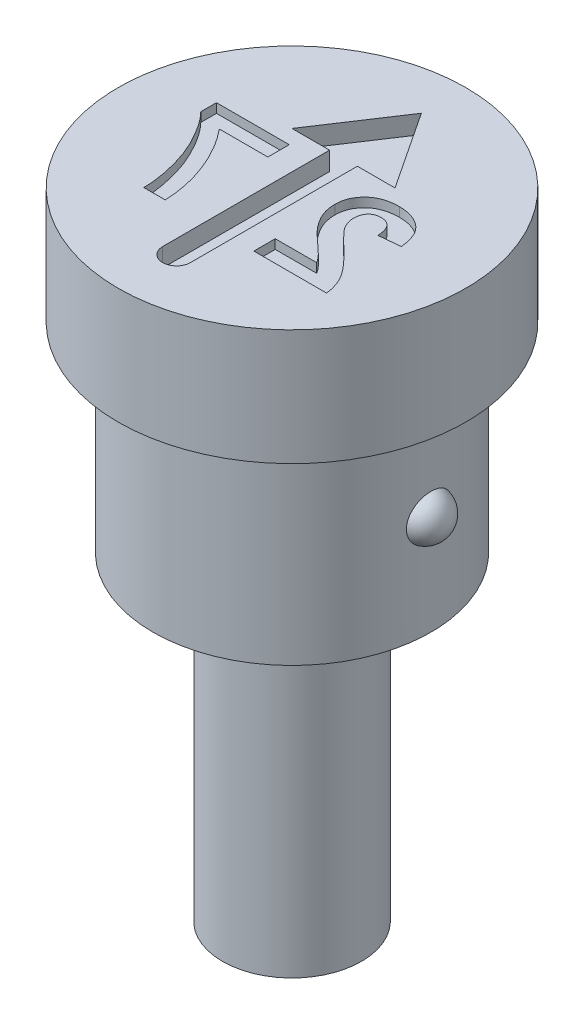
from build123d import *

# Parameters (mm, degrees)
CUT_EXTRUDE1_DEPTH = 0.4
CUT_EXTRUDE2_DEPTH = 0.2


with BuildPart() as part:
    # Sketch1 → Revolve1 (revolve)
    with BuildSketch(Plane.XY, mode=Mode.PRIVATE) as revolve1_sk:
        Polygon((0, 0), (-3.75, 0), (-3.75, -2.5), (-3, -2.5), (-3, -6.8), (-1.5, -6.8), (-1.5, -13.7), (0, -13.7), align=None)
    revolve(revolve1_sk.sketch.rotate(Axis((0, 0, 0), (0, -1, 0)), 270), axis=Axis((0, 0, 0), (0, -1, 0)))

    # Sketch3 → Cut-Extrude1 (cut)
    with BuildSketch(Plane(origin=(0, 0, 0), x_dir=(1, 0, 0), z_dir=(0, 1, 0))):
        with BuildLine():
            Line((0, 2.79), (-1.111967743, 1.11))
            Line((-1.111967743, 1.11), (-0.3, 1.11))
            Line((-0.3, 1.11), (-0.3, -2.49))
            ThreePointArc((-0.3, -2.49), (0, -2.79), (0.3, -2.49))
            Line((0.3, -2.49), (0.3, 1.11))
            Line((0.3, 1.11), (1.111967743, 1.11))
            Line((1.111967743, 1.11), (0, 2.79))
        make_face()
    extrude(amount=-CUT_EXTRUDE1_DEPTH, mode=Mode.SUBTRACT)

    # Sketch4 → Cut-Extrude2 (cut)
    with BuildSketch(Plane(origin=(0, 0, 0), x_dir=(1, 0, 0), z_dir=(0, 1, 0))):
        with BuildLine():
            Line((0.768356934, -1.129759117), (0.768356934, -1.591297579))
            Line((0.768356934, -1.591297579), (2.337587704, -1.591297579))
            add(Edge.make_bspline(
                [(2.337587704, -1.591297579), (2.332274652, -1.551852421), (2.321651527, -1.472984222), (2.288808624, -1.357777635), (2.244974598, -1.24535569), (2.19740109, -1.153871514), (2.150083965, -1.080229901), (2.107153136, -1.019887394), (2.055938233, -0.955685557), (1.99718244, -0.887106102), (1.931210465, -0.813934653), (1.857530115, -0.736443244), (1.775789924, -0.655002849), (1.718284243, -0.599700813), (1.688549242, -0.571105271)],
                knots=[0, 0, 0, 0, 1.156289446, 2.311930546, 3.473459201, 4.661751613, 5.303057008, 6.018253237, 6.81459331, 7.690699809, 8.644447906, 9.679642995, 10.800191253, 12, 12, 12, 12], degree=3))
            add(Edge.make_bspline(
                [(1.688549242, -0.571105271), (1.664820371, -0.548200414), (1.619647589, -0.504596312), (1.55532146, -0.442157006), (1.498772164, -0.384757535), (1.448817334, -0.333885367), (1.406610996, -0.288245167), (1.371597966, -0.248553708), (1.343334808, -0.214649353), (1.328027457, -0.193140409), (1.32124155, -0.183605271)],
                knots=[0, 0, 0, 0, 1.480720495, 2.818855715, 4.024636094, 5.098235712, 6.019786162, 6.815086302, 7.474715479, 8, 8, 8, 8], degree=3))
            add(Edge.make_bspline(
                [(1.32124155, -0.183605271), (1.307345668, -0.160522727), (1.280542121, -0.115999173), (1.251149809, -0.045985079), (1.233507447, 0.024014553), (1.231086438, 0.070787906), (1.229895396, 0.093798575)],
                knots=[0, 0, 0, 0, 1.0911822, 2.104764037, 3.067617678, 4, 4, 4, 4], degree=3))
            add(Edge.make_bspline(
                [(1.229895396, 0.093798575), (1.230759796, 0.11774427), (1.232395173, 0.163047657), (1.246108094, 0.226979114), (1.270425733, 0.281937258), (1.303906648, 0.328090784), (1.346243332, 0.364251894), (1.395736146, 0.390971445), (1.453109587, 0.405743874), (1.493435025, 0.40768691), (1.51451078, 0.408702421)],
                knots=[0, 0, 0, 0, 1.193122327, 2.257294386, 3.237245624, 4.168877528, 5.075331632, 5.990371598, 6.949684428, 8, 8, 8, 8], degree=3))
            add(Edge.make_bspline(
                [(1.51451078, 0.408702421), (1.53544415, 0.40775401), (1.575882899, 0.405921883), (1.633355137, 0.389916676), (1.683632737, 0.362209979), (1.719463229, 0.330635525), (1.743668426, 0.299931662), (1.760161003, 0.273175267), (1.774376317, 0.242771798), (1.786972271, 0.209063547), (1.79692165, 0.171664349), (1.804934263, 0.130859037), (1.811391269, 0.086428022), (1.813444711, 0.055518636), (1.81451078, 0.039471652)],
                knots=[0, 0, 0, 0, 1.402788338, 2.709884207, 3.961032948, 5.225417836, 5.883680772, 6.578928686, 7.329201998, 8.132101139, 8.990263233, 9.922304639, 10.921339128, 12, 12, 12, 12], degree=3))
            Line((1.81451078, 0.039471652), (2.276049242, 0.08466396))
            add(Edge.make_bspline(
                [(2.276049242, 0.08466396), (2.272338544, 0.115823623), (2.265144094, 0.176237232), (2.247190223, 0.263012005), (2.224452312, 0.34306565), (2.195846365, 0.416249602), (2.162554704, 0.48302924), (2.122879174, 0.542402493), (2.078206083, 0.59502705), (2.028496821, 0.640874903), (1.974067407, 0.680091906), (1.916953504, 0.715099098), (1.856038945, 0.743816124), (1.791994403, 0.767483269), (1.724848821, 0.786397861), (1.65429164, 0.798903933), (1.580758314, 0.807700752), (1.530564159, 0.808363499), (1.504895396, 0.808702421)],
                knots=[0, 0, 0, 0, 1.270971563, 2.464210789, 3.586263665, 4.638946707, 5.643716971, 6.603612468, 7.52484387, 8.434700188, 9.336036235, 10.239171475, 11.145359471, 12.059630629, 13.003312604, 13.96741569, 14.960557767, 16, 16, 16, 16], degree=3))
            add(Edge.make_bspline(
                [(1.504895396, 0.808702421), (1.476990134, 0.808166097), (1.422641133, 0.807121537), (1.343301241, 0.798495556), (1.268767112, 0.783454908), (1.198387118, 0.763531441), (1.132884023, 0.736932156), (1.071711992, 0.704774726), (1.015833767, 0.665838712), (0.964416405, 0.62224746), (0.918453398, 0.574311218), (0.878193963, 0.523179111), (0.844464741, 0.468886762), (0.816160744, 0.412095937), (0.795145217, 0.351892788), (0.77983239, 0.289109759), (0.769679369, 0.223453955), (0.768802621, 0.17861253), (0.768356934, 0.155817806)],
                knots=[0, 0, 0, 0, 1.210756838, 2.35810096, 3.457354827, 4.507168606, 5.527358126, 6.519769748, 7.499700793, 8.476517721, 9.440526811, 10.376769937, 11.295256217, 12.209626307, 13.124630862, 14.055668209, 15.011616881, 16, 16, 16, 16], degree=3))
            add(Edge.make_bspline(
                [(0.768356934, 0.155817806), (0.768944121, 0.129656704), (0.770109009, 0.077757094), (0.781261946, 0.001033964), (0.798301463, -0.07391994), (0.823484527, -0.147287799), (0.855406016, -0.220829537), (0.89655358, -0.294710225), (0.944329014, -0.371157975), (0.981735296, -0.420584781), (1.001049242, -0.446105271)],
                knots=[0, 0, 0, 0, 0.953409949, 1.89141903, 2.821310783, 3.752688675, 4.715703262, 5.740811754, 6.833515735, 8, 8, 8, 8], degree=3))
            add(Edge.make_bspline(
                [(1.001049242, -0.446105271), (1.008349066, -0.45529942), (1.023983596, -0.474991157), (1.05058204, -0.505185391), (1.081407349, -0.538167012), (1.116024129, -0.574553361), (1.15557584, -0.613055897), (1.198639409, -0.655284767), (1.247109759, -0.699079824), (1.297313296, -0.745533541), (1.347735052, -0.790746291), (1.394079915, -0.833688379), (1.436176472, -0.871682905), (1.472064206, -0.906827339), (1.503854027, -0.9367231), (1.530400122, -0.962903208), (1.552199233, -0.984733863), (1.582237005, -1.018762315), (1.62045666, -1.064785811), (1.647345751, -1.108762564), (1.660183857, -1.129759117)],
                knots=[0, 0, 0, 0, 0.665555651, 1.425465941, 2.280616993, 3.225313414, 4.272635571, 5.410053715, 6.644756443, 7.976022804, 9.288331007, 10.484517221, 11.558462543, 12.503158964, 13.33222979, 14.032602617, 14.617328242, 15.080653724, 16.606167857, 18, 18, 18, 18], degree=3))
            Line((1.660183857, -1.129759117), (0.768356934, -1.129759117))
        make_face()
        with BuildLine():
            Line((-0.837796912, 0.316394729), (-0.837796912, 0.77793319))
            Line((-0.837796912, 0.77793319), (-2.407027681, 0.77793319))
            Line((-2.407027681, 0.77793319), (-2.407027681, 0.439471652))
            add(Edge.make_bspline(
                [(-2.407027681, 0.439471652), (-2.390657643, 0.422815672), (-2.357005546, 0.388575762), (-2.308802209, 0.332538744), (-2.259884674, 0.271728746), (-2.211275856, 0.205326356), (-2.161464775, 0.134380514), (-2.112640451, 0.057531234), (-2.063121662, -0.024224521), (-1.996453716, -0.139868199), (-1.918527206, -0.290934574), (-1.83608508, -0.478717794), (-1.765848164, -0.67226801), (-1.717753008, -0.837187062), (-1.685256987, -0.969369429), (-1.66402566, -1.066024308), (-1.646153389, -1.159959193), (-1.631614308, -1.251339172), (-1.620763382, -1.340205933), (-1.6121893, -1.426250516), (-1.60795921, -1.509682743), (-1.607335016, -1.564370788), (-1.607027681, -1.591297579)],
                knots=[0, 0, 0, 0, 0.628545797, 1.29210959, 1.98878689, 2.729126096, 3.507039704, 4.322017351, 5.179550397, 6.080149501, 7.915136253, 9.752312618, 11.597470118, 13.454141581, 14.373891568, 15.261584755, 16.117868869, 16.947726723, 17.752002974, 18.527724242, 19.275094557, 20, 20, 20, 20], degree=3))
            Line((-1.607027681, -1.591297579), (-1.14548922, -1.591297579))
            add(Edge.make_bspline(
                [(-1.14548922, -1.591297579), (-1.1470325, -1.550410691), (-1.150136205, -1.468182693), (-1.161748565, -1.34476115), (-1.179987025, -1.220880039), (-1.202640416, -1.096253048), (-1.23254854, -0.971183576), (-1.266682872, -0.845208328), (-1.308031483, -0.719000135), (-1.354382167, -0.592800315), (-1.405550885, -0.467807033), (-1.461317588, -0.345570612), (-1.521538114, -0.226853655), (-1.585429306, -0.11123905), (-1.653734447, 0.000901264), (-1.726504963, 0.109445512), (-1.802708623, 0.215178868), (-1.857195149, 0.282661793), (-1.884431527, 0.316394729)],
                knots=[0, 0, 0, 0, 0.943249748, 1.896978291, 2.856365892, 3.829648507, 4.816416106, 5.820376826, 6.838120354, 7.877341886, 8.919613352, 9.951365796, 10.974227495, 11.988073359, 12.996274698, 14.000568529, 15.000536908, 16, 16, 16, 16], degree=3))
            Line((-1.884431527, 0.316394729), (-0.837796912, 0.316394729))
        make_face()
    extrude(amount=-CUT_EXTRUDE2_DEPTH, mode=Mode.SUBTRACT)

    # Sketch5 → Revolve2 (revolve)
    with BuildSketch(Plane.XY):
        with BuildLine():
            Line((2.869543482, -4.15), (2.869543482, -5.15))
            ThreePointArc((2.869543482, -5.15), (3.369543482, -4.65), (2.869543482, -4.15))
        make_face()
    revolve(axis=Axis((2.869543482, -4.15, 0), (0, -1, 0)))


solid = part.part
